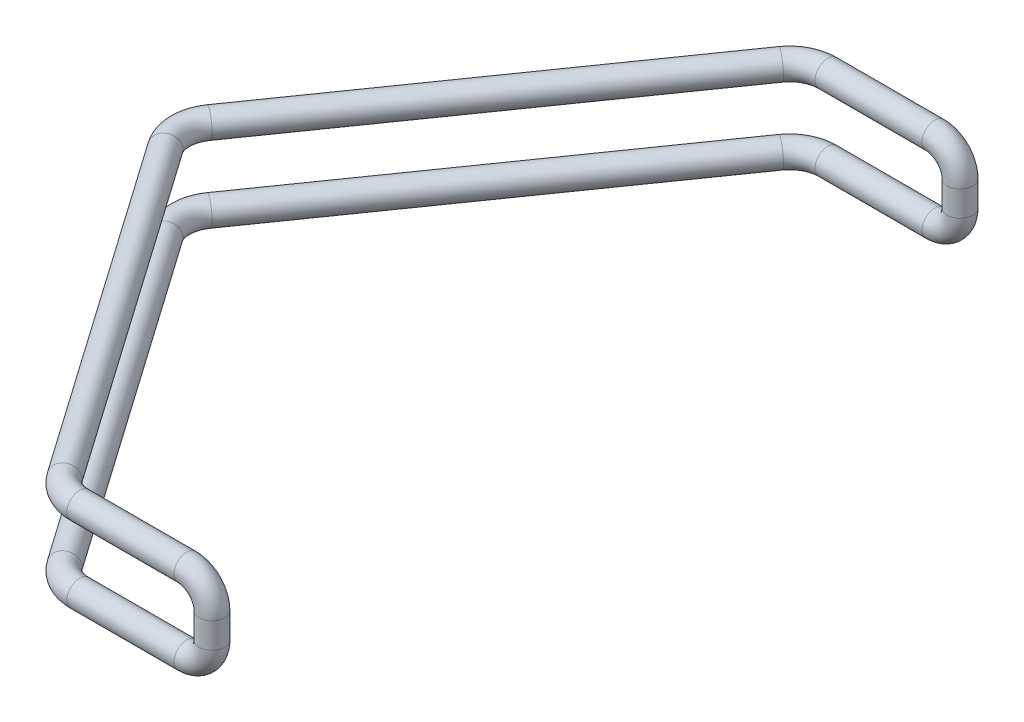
from build123d import *

# Parameters (mm, degrees)
SKETCH1_R = 3.175


with BuildPart() as part:
    # Sweep1: sweep along a curve in space
    with BuildLine() as sweep1_path:
        Line((0, 0, 0), (0, 3.175, 0))
        ThreePointArc((0, 3.175, 0), (-1.859871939, 7.665128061, 0), (-6.35, 9.525, 0))
        Line((-6.35, 9.525, 0), (-33.141598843, 9.525, 0))
        ThreePointArc((-33.141598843, 9.525, 0), (-37.539754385, 9.525, 1.076221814), (-40.944022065, 9.525, 4.061684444))
        Line((-40.944022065, 9.525, 4.061684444), (-99.834331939, 9.525, 88.165763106))
        ThreePointArc((-99.834331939, 9.525, 99.092394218), (-101.556908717, 9.525, 93.629078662), (-99.834331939, 9.525, 88.165763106))
        Line((-99.834331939, 9.525, 99.092394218), (-40.944022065, 9.525, 183.196472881))
        ThreePointArc((-33.141598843, 9.525, 187.258157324), (-37.539754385, 9.525, 186.18193551), (-40.944022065, 9.525, 183.196472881))
        Line((-33.141598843, 9.525, 187.258157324), (-6.35, 9.525, 187.258157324))
        ThreePointArc((0, 3.175, 187.258157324), (-1.859871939, 7.665128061, 187.258157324), (-6.35, 9.525, 187.258157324))
        Line((0, 3.175, 187.258157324), (0, 0, 187.258157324))
    # Sketch1 → Sweep1 (sweep)
    with BuildSketch(Plane(origin=(0, 0, 0), x_dir=(1, 0, 0), z_dir=(0, 1, 0))):
        Circle(SKETCH1_R)
    sweep1 = sweep(path=sweep1_path.line)

    # Mirror1: Sweep1 across plane
    add(sweep1.mirror(Plane.ZX))


solid = part.part
